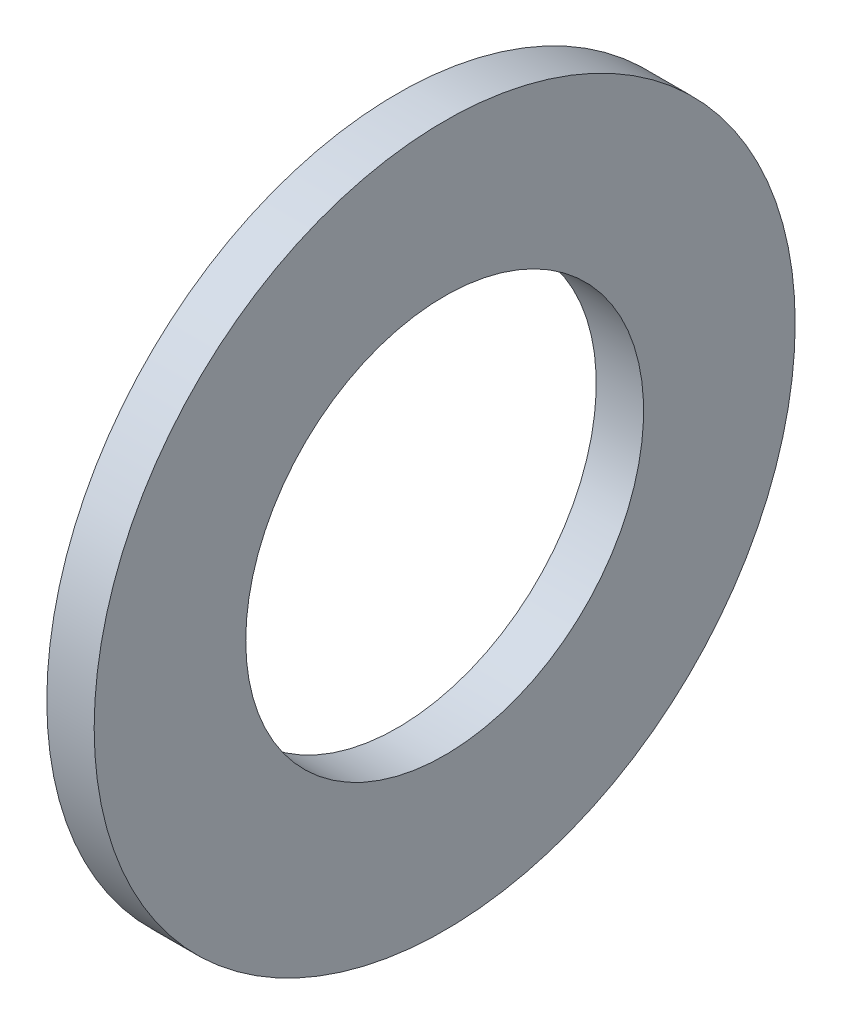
ISO-10303-21;
HEADER;
FILE_DESCRIPTION(('STEP AP214'),'2;1');
FILE_NAME('part.step','',(''),(''),'','','');
FILE_SCHEMA(('AUTOMOTIVE_DESIGN { 1 0 10303 214 1 1 1 1 }'));
ENDSEC;
DATA;
#1=APPLICATION_CONTEXT('core data for automotive mechanical design processes');
#2=APPLICATION_PROTOCOL_DEFINITION('international standard','automotive_design',2000,#1);
#3=PRODUCT_CONTEXT('',#1,'mechanical');
#4=PRODUCT('Part','Part','',(#3));
#5=PRODUCT_RELATED_PRODUCT_CATEGORY('part','',(#4));
#6=PRODUCT_DEFINITION_FORMATION('','',#4);
#7=PRODUCT_DEFINITION_CONTEXT('part definition',#1,'design');
#8=PRODUCT_DEFINITION('design','',#6,#7);
#9=PRODUCT_DEFINITION_SHAPE('','',#8);
#10=(LENGTH_UNIT() NAMED_UNIT(*) SI_UNIT(.MILLI.,.METRE.));
#11=(NAMED_UNIT(*) PLANE_ANGLE_UNIT() SI_UNIT($,.RADIAN.));
#12=(NAMED_UNIT(*) SI_UNIT($,.STERADIAN.) SOLID_ANGLE_UNIT());
#13=UNCERTAINTY_MEASURE_WITH_UNIT(LENGTH_MEASURE(1.E-05),#10,'distance_accuracy_value','');
#14=(GEOMETRIC_REPRESENTATION_CONTEXT(3) GLOBAL_UNCERTAINTY_ASSIGNED_CONTEXT((#13)) GLOBAL_UNIT_ASSIGNED_CONTEXT((#10,
#11,#12)) REPRESENTATION_CONTEXT('',''));
#15=CARTESIAN_POINT('',(0.,0.,0.));
#16=DIRECTION('',(0.,0.,1.));
#17=DIRECTION('',(1.,0.,0.));
#18=AXIS2_PLACEMENT_3D('',#15,#16,#17);
#19=CARTESIAN_POINT('',(-2.4980018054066E-13,10.5,0.));
#20=DIRECTION('',(1.,0.,0.));
#21=DIRECTION('',(0.,0.,-1.));
#22=AXIS2_PLACEMENT_3D('',#19,#20,#21);
#23=PLANE('',#22);
#24=CARTESIAN_POINT('',(0.,0.,0.));
#25=DIRECTION('',(-1.,0.,0.));
#26=DIRECTION('',(0.,0.,1.));
#27=AXIS2_PLACEMENT_3D('',#24,#25,#26);
#28=CIRCLE('',#27,10.5);
#29=CARTESIAN_POINT('',(0.,0.,10.5));
#30=VERTEX_POINT('',#29);
#31=EDGE_CURVE('E43',#30,#30,#28,.T.);
#32=ORIENTED_EDGE('',*,*,#31,.F.);
#33=EDGE_LOOP('',(#32));
#34=FACE_BOUND('',#33,.T.);
#35=CARTESIAN_POINT('',(0.,0.,0.));
#36=DIRECTION('',(-1.,0.,0.));
#37=DIRECTION('',(0.,0.,1.));
#38=AXIS2_PLACEMENT_3D('',#35,#36,#37);
#39=CIRCLE('',#38,18.5);
#40=CARTESIAN_POINT('',(0.,0.,18.5));
#41=VERTEX_POINT('',#40);
#42=EDGE_CURVE('E10',#41,#41,#39,.T.);
#43=ORIENTED_EDGE('',*,*,#42,.T.);
#44=EDGE_LOOP('',(#43));
#45=FACE_BOUND('',#44,.T.);
#46=ADVANCED_FACE('F29',(#34,#45),#23,.F.);
#47=CARTESIAN_POINT('',(0.,0.,0.));
#48=DIRECTION('',(-1.,0.,0.));
#49=DIRECTION('',(0.,0.,1.));
#50=AXIS2_PLACEMENT_3D('',#47,#48,#49);
#51=CYLINDRICAL_SURFACE('',#50,18.5);
#52=ORIENTED_EDGE('',*,*,#42,.F.);
#53=EDGE_LOOP('',(#52));
#54=FACE_BOUND('',#53,.T.);
#55=CARTESIAN_POINT('',(2.5,0.,0.));
#56=DIRECTION('',(-1.,0.,0.));
#57=DIRECTION('',(0.,0.,1.));
#58=AXIS2_PLACEMENT_3D('',#55,#56,#57);
#59=CIRCLE('',#58,18.5);
#60=CARTESIAN_POINT('',(2.5,0.,18.5));
#61=VERTEX_POINT('',#60);
#62=EDGE_CURVE('E35',#61,#61,#59,.T.);
#63=ORIENTED_EDGE('',*,*,#62,.T.);
#64=EDGE_LOOP('',(#63));
#65=FACE_BOUND('',#64,.T.);
#66=ADVANCED_FACE('F52',(#54,#65),#51,.T.);
#67=CARTESIAN_POINT('',(2.49999999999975,10.5,0.));
#68=DIRECTION('',(-1.,0.,0.));
#69=DIRECTION('',(0.,0.,1.));
#70=AXIS2_PLACEMENT_3D('',#67,#68,#69);
#71=PLANE('',#70);
#72=ORIENTED_EDGE('',*,*,#62,.F.);
#73=EDGE_LOOP('',(#72));
#74=FACE_BOUND('',#73,.T.);
#75=CARTESIAN_POINT('',(2.5,0.,0.));
#76=DIRECTION('',(-1.,0.,0.));
#77=DIRECTION('',(0.,0.,1.));
#78=AXIS2_PLACEMENT_3D('',#75,#76,#77);
#79=CIRCLE('',#78,10.5);
#80=CARTESIAN_POINT('',(2.5,0.,10.5));
#81=VERTEX_POINT('',#80);
#82=EDGE_CURVE('E39',#81,#81,#79,.T.);
#83=ORIENTED_EDGE('',*,*,#82,.T.);
#84=EDGE_LOOP('',(#83));
#85=FACE_BOUND('',#84,.T.);
#86=ADVANCED_FACE('F56',(#74,#85),#71,.F.);
#87=CARTESIAN_POINT('',(0.,0.,0.));
#88=DIRECTION('',(-1.,0.,0.));
#89=DIRECTION('',(0.,0.,1.));
#90=AXIS2_PLACEMENT_3D('',#87,#88,#89);
#91=CYLINDRICAL_SURFACE('',#90,10.5);
#92=ORIENTED_EDGE('',*,*,#82,.F.);
#93=EDGE_LOOP('',(#92));
#94=FACE_BOUND('',#93,.T.);
#95=ORIENTED_EDGE('',*,*,#31,.T.);
#96=EDGE_LOOP('',(#95));
#97=FACE_BOUND('',#96,.T.);
#98=ADVANCED_FACE('F49',(#94,#97),#91,.F.);
#99=CLOSED_SHELL('',(#46,#66,#86,#98));
#100=MANIFOLD_SOLID_BREP('B2',#99);
#101=ADVANCED_BREP_SHAPE_REPRESENTATION('',(#18,#100),#14);
#102=SHAPE_DEFINITION_REPRESENTATION(#9,#101);
ENDSEC;
END-ISO-10303-21;
